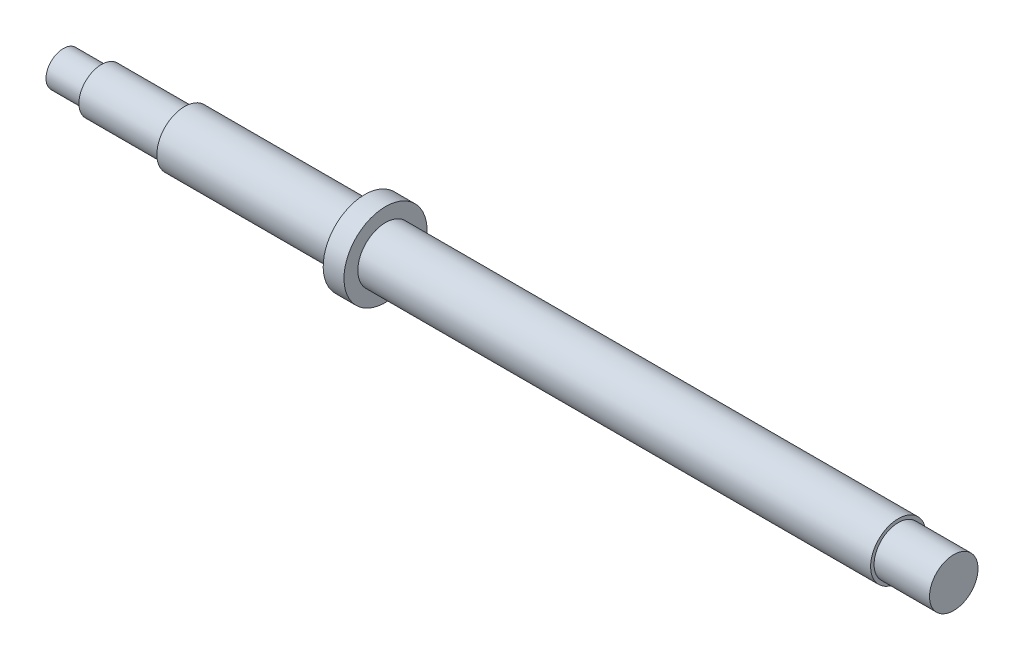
from build123d import *


with BuildPart() as part:
    # Sketch2 → Revolve1 (revolve)
    with BuildSketch(Plane.XY):
        Polygon((0, 0), (0, 5), (11, 5), (11, 6.5), (35, 6.5), (35, 8), (87, 8), (87, 12), (93, 12), (93, 8), (241, 8), (241, 7), (257, 7), (257, 0), align=None)
    revolve(axis=Axis((257, 0, 0), (-1, 0, 0)))


solid = part.part
